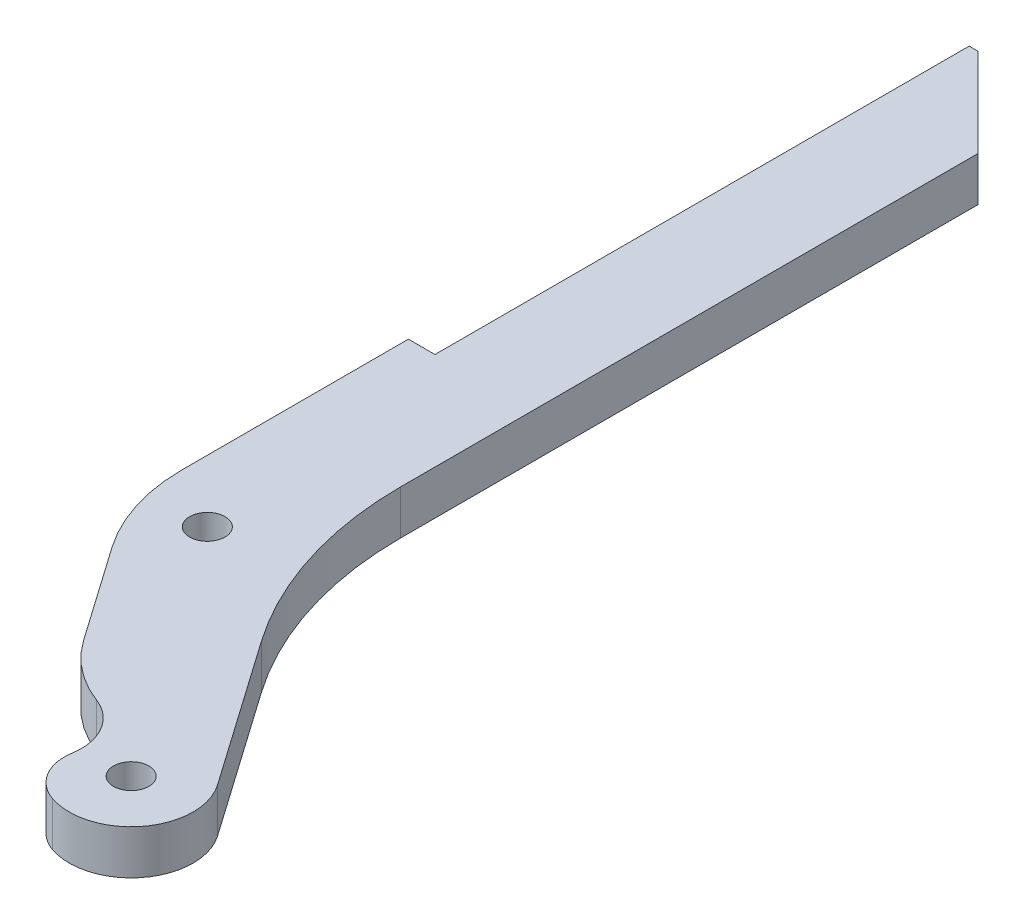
ISO-10303-21;
HEADER;
FILE_DESCRIPTION(('STEP AP214'),'2;1');
FILE_NAME('part.step','',(''),(''),'','','');
FILE_SCHEMA(('AUTOMOTIVE_DESIGN { 1 0 10303 214 1 1 1 1 }'));
ENDSEC;
DATA;
#1=APPLICATION_CONTEXT('core data for automotive mechanical design processes');
#2=APPLICATION_PROTOCOL_DEFINITION('international standard','automotive_design',2000,#1);
#3=PRODUCT_CONTEXT('',#1,'mechanical');
#4=PRODUCT('Part','Part','',(#3));
#5=PRODUCT_RELATED_PRODUCT_CATEGORY('part','',(#4));
#6=PRODUCT_DEFINITION_FORMATION('','',#4);
#7=PRODUCT_DEFINITION_CONTEXT('part definition',#1,'design');
#8=PRODUCT_DEFINITION('design','',#6,#7);
#9=PRODUCT_DEFINITION_SHAPE('','',#8);
#10=(LENGTH_UNIT() NAMED_UNIT(*) SI_UNIT(.MILLI.,.METRE.));
#11=(NAMED_UNIT(*) PLANE_ANGLE_UNIT() SI_UNIT($,.RADIAN.));
#12=(NAMED_UNIT(*) SI_UNIT($,.STERADIAN.) SOLID_ANGLE_UNIT());
#13=UNCERTAINTY_MEASURE_WITH_UNIT(LENGTH_MEASURE(1.E-05),#10,'distance_accuracy_value','');
#14=(GEOMETRIC_REPRESENTATION_CONTEXT(3) GLOBAL_UNCERTAINTY_ASSIGNED_CONTEXT((#13)) GLOBAL_UNIT_ASSIGNED_CONTEXT((#10,
#11,#12)) REPRESENTATION_CONTEXT('',''));
#15=CARTESIAN_POINT('',(0.,0.,0.));
#16=DIRECTION('',(0.,0.,1.));
#17=DIRECTION('',(1.,0.,0.));
#18=AXIS2_PLACEMENT_3D('',#15,#16,#17);
#19=CARTESIAN_POINT('',(-7.,5.,2.20709152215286));
#20=DIRECTION('',(0.819152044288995,0.,-0.573576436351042));
#21=DIRECTION('',(-0.573576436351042,0.,-0.819152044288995));
#22=AXIS2_PLACEMENT_3D('',#19,#20,#21);
#23=PLANE('',#22);
#24=DIRECTION('',(0.573576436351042,0.,0.819152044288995));
#25=VECTOR('',#24,1.);
#26=CARTESIAN_POINT('',(-7.,0.,2.20709152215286));
#27=LINE('',#26,#25);
#28=CARTESIAN_POINT('',(-3.3830408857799,0.,7.37264447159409));
#29=VERTEX_POINT('',#28);
#30=CARTESIAN_POINT('',(4.12992780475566,0.,18.1022757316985));
#31=VERTEX_POINT('',#30);
#32=EDGE_CURVE('E252',#29,#31,#27,.T.);
#33=ORIENTED_EDGE('',*,*,#32,.T.);
#34=DIRECTION('',(0.,1.,0.));
#35=VECTOR('',#34,1.);
#36=CARTESIAN_POINT('',(4.12992780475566,5.,18.1022757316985));
#37=LINE('',#36,#35);
#38=CARTESIAN_POINT('',(4.12992780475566,5.,18.1022757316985));
#39=VERTEX_POINT('',#38);
#40=EDGE_CURVE('E330',#31,#39,#37,.T.);
#41=ORIENTED_EDGE('',*,*,#40,.T.);
#42=DIRECTION('',(0.573576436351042,0.,0.819152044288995));
#43=VECTOR('',#42,1.);
#44=CARTESIAN_POINT('',(-7.,5.,2.20709152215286));
#45=LINE('',#44,#43);
#46=CARTESIAN_POINT('',(-3.3830408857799,5.,7.37264447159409));
#47=VERTEX_POINT('',#46);
#48=EDGE_CURVE('E233',#47,#39,#45,.T.);
#49=ORIENTED_EDGE('',*,*,#48,.F.);
#50=DIRECTION('',(0.,-1.,0.));
#51=VECTOR('',#50,1.);
#52=CARTESIAN_POINT('',(-3.3830408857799,5.,7.37264447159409));
#53=LINE('',#52,#51);
#54=EDGE_CURVE('E279',#47,#29,#53,.T.);
#55=ORIENTED_EDGE('',*,*,#54,.T.);
#56=EDGE_LOOP('',(#33,#41,#49,#55));
#57=FACE_BOUND('',#56,.T.);
#58=ADVANCED_FACE('F50',(#57),#23,.F.);
#59=CARTESIAN_POINT('',(20.0751752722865,0.,28.6703215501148));
#60=DIRECTION('',(0.,1.,0.));
#61=DIRECTION('',(0.,0.,1.));
#62=AXIS2_PLACEMENT_3D('',#59,#60,#61);
#63=PLANE('',#62);
#64=CARTESIAN_POINT('',(0.,0.,0.));
#65=DIRECTION('',(0.,1.,0.));
#66=DIRECTION('',(0.,0.,1.));
#67=AXIS2_PLACEMENT_3D('',#64,#65,#66);
#68=CIRCLE('',#67,2.);
#69=CARTESIAN_POINT('',(0.,0.,2.));
#70=VERTEX_POINT('',#69);
#71=EDGE_CURVE('E210',#70,#70,#68,.T.);
#72=ORIENTED_EDGE('',*,*,#71,.T.);
#73=EDGE_LOOP('',(#72));
#74=FACE_BOUND('',#73,.T.);
#75=CARTESIAN_POINT('',(20.0751752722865,0.,28.6703215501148));
#76=DIRECTION('',(0.,1.,0.));
#77=DIRECTION('',(0.,0.,1.));
#78=AXIS2_PLACEMENT_3D('',#75,#76,#77);
#79=CIRCLE('',#78,2.);
#80=CARTESIAN_POINT('',(20.0751752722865,0.,30.6703215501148));
#81=VERTEX_POINT('',#80);
#82=EDGE_CURVE('E196',#81,#81,#79,.T.);
#83=ORIENTED_EDGE('',*,*,#82,.T.);
#84=EDGE_LOOP('',(#83));
#85=FACE_BOUND('',#84,.T.);
#86=CARTESIAN_POINT('',(20.0751752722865,0.,28.6703215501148));
#87=DIRECTION('',(0.,1.,0.));
#88=DIRECTION('',(0.,0.,1.));
#89=AXIS2_PLACEMENT_3D('',#86,#87,#88);
#90=CIRCLE('',#89,7.);
#91=CARTESIAN_POINT('',(17.7909773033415,0.,35.2871515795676));
#92=VERTEX_POINT('',#91);
#93=CARTESIAN_POINT('',(25.8092395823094,0.,24.6552864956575));
#94=VERTEX_POINT('',#93);
#95=EDGE_CURVE('E253',#92,#94,#90,.T.);
#96=ORIENTED_EDGE('',*,*,#95,.F.);
#97=CARTESIAN_POINT('',(19.4225472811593,0.,30.5608444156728));
#98=DIRECTION('',(0.,1.,0.));
#99=DIRECTION('',(0.,0.,1.));
#100=AXIS2_PLACEMENT_3D('',#97,#98,#99);
#101=CIRCLE('',#100,5.);
#102=CARTESIAN_POINT('',(14.4795454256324,0.,29.8080279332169));
#103=VERTEX_POINT('',#102);
#104=EDGE_CURVE('E68',#92,#103,#101,.F.);
#105=ORIENTED_EDGE('',*,*,#104,.T.);
#106=CARTESIAN_POINT('',(28.3199506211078,0.,31.9159140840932));
#107=DIRECTION('',(0.,1.,0.));
#108=DIRECTION('',(0.,0.,1.));
#109=AXIS2_PLACEMENT_3D('',#106,#107,#108);
#110=CIRCLE('',#109,14.);
#111=CARTESIAN_POINT('',(14.4914739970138,0.,29.7311408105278));
#112=VERTEX_POINT('',#111);
#113=EDGE_CURVE('E325',#103,#112,#110,.F.);
#114=ORIENTED_EDGE('',*,*,#113,.T.);
#115=CARTESIAN_POINT('',(8.56498401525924,0.,28.7948094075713));
#116=DIRECTION('',(0.,1.,0.));
#117=DIRECTION('',(0.,0.,1.));
#118=AXIS2_PLACEMENT_3D('',#115,#116,#117);
#119=CIRCLE('',#118,6.);
#120=CARTESIAN_POINT('',(10.6749057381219,0.,23.178028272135));
#121=VERTEX_POINT('',#120);
#122=EDGE_CURVE('E433',#121,#112,#119,.F.);
#123=ORIENTED_EDGE('',*,*,#122,.F.);
#124=CARTESIAN_POINT('',(15.5980564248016,0.,10.0722056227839));
#125=DIRECTION('',(0.,1.,0.));
#126=DIRECTION('',(0.,0.,1.));
#127=AXIS2_PLACEMENT_3D('',#124,#125,#126);
#128=CIRCLE('',#127,14.);
#129=EDGE_CURVE('E323',#121,#31,#128,.F.);
#130=ORIENTED_EDGE('',*,*,#129,.T.);
#131=ORIENTED_EDGE('',*,*,#32,.F.);
#132=CARTESIAN_POINT('',(13.,0.,-4.09888425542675));
#133=DIRECTION('',(0.,1.,0.));
#134=DIRECTION('',(0.,0.,1.));
#135=AXIS2_PLACEMENT_3D('',#132,#133,#134);
#136=CIRCLE('',#135,20.);
#137=CARTESIAN_POINT('',(-7.,0.,-4.09888425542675));
#138=VERTEX_POINT('',#137);
#139=EDGE_CURVE('E282',#29,#138,#136,.F.);
#140=ORIENTED_EDGE('',*,*,#139,.T.);
#141=DIRECTION('',(0.,0.,1.));
#142=VECTOR('',#141,1.);
#143=CARTESIAN_POINT('',(-7.,0.,2.20709152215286));
#144=LINE('',#143,#142);
#145=CARTESIAN_POINT('',(-7.,0.,-29.7));
#146=VERTEX_POINT('',#145);
#147=EDGE_CURVE('E178',#146,#138,#144,.T.);
#148=ORIENTED_EDGE('',*,*,#147,.F.);
#149=DIRECTION('',(-1.,0.,0.));
#150=VECTOR('',#149,1.);
#151=CARTESIAN_POINT('',(-4.,0.,-29.7));
#152=LINE('',#151,#150);
#153=CARTESIAN_POINT('',(-4.,0.,-29.7));
#154=VERTEX_POINT('',#153);
#155=EDGE_CURVE('E166',#154,#146,#152,.T.);
#156=ORIENTED_EDGE('',*,*,#155,.F.);
#157=DIRECTION('',(0.,0.,1.));
#158=VECTOR('',#157,1.);
#159=CARTESIAN_POINT('',(-4.,0.,-29.7));
#160=LINE('',#159,#158);
#161=CARTESIAN_POINT('',(-4.,0.,-90.));
#162=VERTEX_POINT('',#161);
#163=EDGE_CURVE('E154',#162,#154,#160,.T.);
#164=ORIENTED_EDGE('',*,*,#163,.F.);
#165=DIRECTION('',(-1.,0.,0.));
#166=VECTOR('',#165,1.);
#167=CARTESIAN_POINT('',(-7.,0.,-90.));
#168=LINE('',#167,#166);
#169=CARTESIAN_POINT('',(-3.00000000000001,0.,-90.));
#170=VERTEX_POINT('',#169);
#171=EDGE_CURVE('E246',#170,#162,#168,.T.);
#172=ORIENTED_EDGE('',*,*,#171,.F.);
#173=DIRECTION('',(-0.707106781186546,0.,-0.707106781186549));
#174=VECTOR('',#173,1.);
#175=CARTESIAN_POINT('',(-3.00000000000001,0.,-90.));
#176=LINE('',#175,#174);
#177=CARTESIAN_POINT('',(7.,0.,-79.9999999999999));
#178=VERTEX_POINT('',#177);
#179=EDGE_CURVE('E294',#170,#178,#176,.F.);
#180=ORIENTED_EDGE('',*,*,#179,.T.);
#181=DIRECTION('',(0.,0.,-1.));
#182=VECTOR('',#181,1.);
#183=CARTESIAN_POINT('',(7.,0.,-2.20709152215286));
#184=LINE('',#183,#182);
#185=CARTESIAN_POINT('',(7.,0.,-14.8190430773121));
#186=VERTEX_POINT('',#185);
#187=EDGE_CURVE('E211',#186,#178,#184,.T.);
#188=ORIENTED_EDGE('',*,*,#187,.F.);
#189=CARTESIAN_POINT('',(47.,0.,-14.8190430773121));
#190=DIRECTION('',(0.,1.,0.));
#191=DIRECTION('',(0.,0.,1.));
#192=AXIS2_PLACEMENT_3D('',#189,#190,#191);
#193=CIRCLE('',#192,40.);
#194=CARTESIAN_POINT('',(14.2339182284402,0.,8.12401437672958));
#195=VERTEX_POINT('',#194);
#196=EDGE_CURVE('E272',#186,#195,#193,.T.);
#197=ORIENTED_EDGE('',*,*,#196,.T.);
#198=DIRECTION('',(-0.573576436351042,0.,-0.819152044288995));
#199=VECTOR('',#198,1.);
#200=CARTESIAN_POINT('',(7.,0.,-2.20709152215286));
#201=LINE('',#200,#199);
#202=EDGE_CURVE('E223',#94,#195,#201,.T.);
#203=ORIENTED_EDGE('',*,*,#202,.F.);
#204=EDGE_LOOP('',(#96,#105,#114,#123,#130,#131,#140,#148,#156,#164,#172,#180,#188,#197,#203));
#205=FACE_BOUND('',#204,.T.);
#206=ADVANCED_FACE('F176',(#74,#85,#205),#63,.F.);
#207=CARTESIAN_POINT('',(20.0751752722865,5.,28.6703215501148));
#208=DIRECTION('',(0.,1.,0.));
#209=DIRECTION('',(0.,0.,1.));
#210=AXIS2_PLACEMENT_3D('',#207,#208,#209);
#211=PLANE('',#210);
#212=CARTESIAN_POINT('',(28.3199506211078,5.,31.9159140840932));
#213=DIRECTION('',(0.,1.,0.));
#214=DIRECTION('',(0.,0.,1.));
#215=AXIS2_PLACEMENT_3D('',#212,#213,#214);
#216=CIRCLE('',#215,14.);
#217=CARTESIAN_POINT('',(14.4914739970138,5.,29.7311408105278));
#218=VERTEX_POINT('',#217);
#219=CARTESIAN_POINT('',(14.4795454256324,5.,29.8080279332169));
#220=VERTEX_POINT('',#219);
#221=EDGE_CURVE('E319',#218,#220,#216,.T.);
#222=ORIENTED_EDGE('',*,*,#221,.T.);
#223=CARTESIAN_POINT('',(19.4225472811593,5.,30.5608444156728));
#224=DIRECTION('',(0.,1.,0.));
#225=DIRECTION('',(0.,0.,1.));
#226=AXIS2_PLACEMENT_3D('',#223,#224,#225);
#227=CIRCLE('',#226,5.);
#228=CARTESIAN_POINT('',(17.7909773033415,5.,35.2871515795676));
#229=VERTEX_POINT('',#228);
#230=EDGE_CURVE('E11',#220,#229,#227,.T.);
#231=ORIENTED_EDGE('',*,*,#230,.T.);
#232=CARTESIAN_POINT('',(20.0751752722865,5.,28.6703215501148));
#233=DIRECTION('',(0.,1.,0.));
#234=DIRECTION('',(0.,0.,1.));
#235=AXIS2_PLACEMENT_3D('',#232,#233,#234);
#236=CIRCLE('',#235,7.);
#237=CARTESIAN_POINT('',(25.8092395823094,5.,24.6552864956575));
#238=VERTEX_POINT('',#237);
#239=EDGE_CURVE('E232',#229,#238,#236,.T.);
#240=ORIENTED_EDGE('',*,*,#239,.T.);
#241=DIRECTION('',(-0.573576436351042,0.,-0.819152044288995));
#242=VECTOR('',#241,1.);
#243=CARTESIAN_POINT('',(7.,5.,-2.20709152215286));
#244=LINE('',#243,#242);
#245=CARTESIAN_POINT('',(14.2339182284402,5.,8.12401437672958));
#246=VERTEX_POINT('',#245);
#247=EDGE_CURVE('E238',#238,#246,#244,.T.);
#248=ORIENTED_EDGE('',*,*,#247,.T.);
#249=CARTESIAN_POINT('',(47.,5.,-14.8190430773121));
#250=DIRECTION('',(0.,1.,0.));
#251=DIRECTION('',(0.,0.,1.));
#252=AXIS2_PLACEMENT_3D('',#249,#250,#251);
#253=CIRCLE('',#252,40.);
#254=CARTESIAN_POINT('',(7.,5.,-14.8190430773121));
#255=VERTEX_POINT('',#254);
#256=EDGE_CURVE('E274',#246,#255,#253,.F.);
#257=ORIENTED_EDGE('',*,*,#256,.T.);
#258=DIRECTION('',(0.,0.,-1.));
#259=VECTOR('',#258,1.);
#260=CARTESIAN_POINT('',(7.,5.,-2.20709152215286));
#261=LINE('',#260,#259);
#262=CARTESIAN_POINT('',(7.,5.,-79.9999999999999));
#263=VERTEX_POINT('',#262);
#264=EDGE_CURVE('E216',#255,#263,#261,.T.);
#265=ORIENTED_EDGE('',*,*,#264,.T.);
#266=DIRECTION('',(0.707106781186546,0.,0.707106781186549));
#267=VECTOR('',#266,1.);
#268=CARTESIAN_POINT('',(67.8727484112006,5.,-19.1272515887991));
#269=LINE('',#268,#267);
#270=CARTESIAN_POINT('',(-3.00000000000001,5.,-90.));
#271=VERTEX_POINT('',#270);
#272=EDGE_CURVE('E301',#263,#271,#269,.F.);
#273=ORIENTED_EDGE('',*,*,#272,.T.);
#274=DIRECTION('',(-1.,0.,0.));
#275=VECTOR('',#274,1.);
#276=CARTESIAN_POINT('',(-7.,5.,-90.));
#277=LINE('',#276,#275);
#278=CARTESIAN_POINT('',(-4.,5.,-90.));
#279=VERTEX_POINT('',#278);
#280=EDGE_CURVE('E225',#271,#279,#277,.T.);
#281=ORIENTED_EDGE('',*,*,#280,.T.);
#282=DIRECTION('',(0.,0.,-1.));
#283=VECTOR('',#282,1.);
#284=CARTESIAN_POINT('',(-4.,5.,-29.7));
#285=LINE('',#284,#283);
#286=CARTESIAN_POINT('',(-4.,5.,-29.7));
#287=VERTEX_POINT('',#286);
#288=EDGE_CURVE('E173',#287,#279,#285,.T.);
#289=ORIENTED_EDGE('',*,*,#288,.F.);
#290=DIRECTION('',(-1.,0.,0.));
#291=VECTOR('',#290,1.);
#292=CARTESIAN_POINT('',(-4.,5.,-29.7));
#293=LINE('',#292,#291);
#294=CARTESIAN_POINT('',(-7.,5.,-29.7));
#295=VERTEX_POINT('',#294);
#296=EDGE_CURVE('E171',#287,#295,#293,.T.);
#297=ORIENTED_EDGE('',*,*,#296,.T.);
#298=DIRECTION('',(0.,0.,1.));
#299=VECTOR('',#298,1.);
#300=CARTESIAN_POINT('',(-7.,5.,2.20709152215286));
#301=LINE('',#300,#299);
#302=CARTESIAN_POINT('',(-7.,5.,-4.09888425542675));
#303=VERTEX_POINT('',#302);
#304=EDGE_CURVE('E226',#295,#303,#301,.T.);
#305=ORIENTED_EDGE('',*,*,#304,.T.);
#306=CARTESIAN_POINT('',(13.,5.,-4.09888425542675));
#307=DIRECTION('',(0.,1.,0.));
#308=DIRECTION('',(0.,0.,1.));
#309=AXIS2_PLACEMENT_3D('',#306,#307,#308);
#310=CIRCLE('',#309,20.);
#311=EDGE_CURVE('E290',#303,#47,#310,.T.);
#312=ORIENTED_EDGE('',*,*,#311,.T.);
#313=ORIENTED_EDGE('',*,*,#48,.T.);
#314=CARTESIAN_POINT('',(15.5980564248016,5.,10.0722056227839));
#315=DIRECTION('',(0.,1.,0.));
#316=DIRECTION('',(0.,0.,1.));
#317=AXIS2_PLACEMENT_3D('',#314,#315,#316);
#318=CIRCLE('',#317,14.);
#319=CARTESIAN_POINT('',(10.6749057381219,5.,23.178028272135));
#320=VERTEX_POINT('',#319);
#321=EDGE_CURVE('E314',#39,#320,#318,.T.);
#322=ORIENTED_EDGE('',*,*,#321,.T.);
#323=CARTESIAN_POINT('',(8.56498401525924,5.,28.7948094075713));
#324=DIRECTION('',(0.,1.,0.));
#325=DIRECTION('',(0.,0.,1.));
#326=AXIS2_PLACEMENT_3D('',#323,#324,#325);
#327=CIRCLE('',#326,6.);
#328=EDGE_CURVE('E437',#218,#320,#327,.T.);
#329=ORIENTED_EDGE('',*,*,#328,.F.);
#330=EDGE_LOOP('',(#222,#231,#240,#248,#257,#265,#273,#281,#289,#297,#305,#312,#313,#322,#329));
#331=FACE_BOUND('',#330,.T.);
#332=CARTESIAN_POINT('',(0.,5.,0.));
#333=DIRECTION('',(0.,1.,0.));
#334=DIRECTION('',(0.,0.,1.));
#335=AXIS2_PLACEMENT_3D('',#332,#333,#334);
#336=CIRCLE('',#335,2.);
#337=CARTESIAN_POINT('',(0.,5.,2.));
#338=VERTEX_POINT('',#337);
#339=EDGE_CURVE('E213',#338,#338,#336,.T.);
#340=ORIENTED_EDGE('',*,*,#339,.F.);
#341=EDGE_LOOP('',(#340));
#342=FACE_BOUND('',#341,.T.);
#343=CARTESIAN_POINT('',(20.0751752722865,5.,28.6703215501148));
#344=DIRECTION('',(0.,1.,0.));
#345=DIRECTION('',(0.,0.,1.));
#346=AXIS2_PLACEMENT_3D('',#343,#344,#345);
#347=CIRCLE('',#346,2.);
#348=CARTESIAN_POINT('',(20.0751752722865,5.,30.6703215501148));
#349=VERTEX_POINT('',#348);
#350=EDGE_CURVE('E205',#349,#349,#347,.T.);
#351=ORIENTED_EDGE('',*,*,#350,.F.);
#352=EDGE_LOOP('',(#351));
#353=FACE_BOUND('',#352,.T.);
#354=ADVANCED_FACE('F352',(#331,#342,#353),#211,.T.);
#355=CARTESIAN_POINT('',(-7.,5.,2.20709152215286));
#356=DIRECTION('',(1.,0.,0.));
#357=DIRECTION('',(0.,0.,-1.));
#358=AXIS2_PLACEMENT_3D('',#355,#356,#357);
#359=PLANE('',#358);
#360=DIRECTION('',(0.,1.,0.));
#361=VECTOR('',#360,1.);
#362=CARTESIAN_POINT('',(-7.,0.,-29.7));
#363=LINE('',#362,#361);
#364=EDGE_CURVE('E165',#146,#295,#363,.T.);
#365=ORIENTED_EDGE('',*,*,#364,.F.);
#366=ORIENTED_EDGE('',*,*,#147,.T.);
#367=DIRECTION('',(0.,-1.,0.));
#368=VECTOR('',#367,1.);
#369=CARTESIAN_POINT('',(-7.,5.,-4.09888425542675));
#370=LINE('',#369,#368);
#371=EDGE_CURVE('E281',#138,#303,#370,.F.);
#372=ORIENTED_EDGE('',*,*,#371,.T.);
#373=ORIENTED_EDGE('',*,*,#304,.F.);
#374=EDGE_LOOP('',(#365,#366,#372,#373));
#375=FACE_BOUND('',#374,.T.);
#376=ADVANCED_FACE('F368',(#375),#359,.F.);
#377=CARTESIAN_POINT('',(-7.,5.,-90.));
#378=DIRECTION('',(0.,0.,1.));
#379=DIRECTION('',(1.,0.,0.));
#380=AXIS2_PLACEMENT_3D('',#377,#378,#379);
#381=PLANE('',#380);
#382=DIRECTION('',(0.,-1.,0.));
#383=VECTOR('',#382,1.);
#384=CARTESIAN_POINT('',(-4.,5.,-90.));
#385=LINE('',#384,#383);
#386=EDGE_CURVE('E158',#279,#162,#385,.T.);
#387=ORIENTED_EDGE('',*,*,#386,.F.);
#388=ORIENTED_EDGE('',*,*,#280,.F.);
#389=DIRECTION('',(0.,-1.,0.));
#390=VECTOR('',#389,1.);
#391=CARTESIAN_POINT('',(-3.00000000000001,5.,-90.));
#392=LINE('',#391,#390);
#393=EDGE_CURVE('E293',#271,#170,#392,.T.);
#394=ORIENTED_EDGE('',*,*,#393,.T.);
#395=ORIENTED_EDGE('',*,*,#171,.T.);
#396=EDGE_LOOP('',(#387,#388,#394,#395));
#397=FACE_BOUND('',#396,.T.);
#398=ADVANCED_FACE('F366',(#397),#381,.F.);
#399=CARTESIAN_POINT('',(7.,5.,-2.20709152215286));
#400=DIRECTION('',(-1.,0.,0.));
#401=DIRECTION('',(0.,0.,1.));
#402=AXIS2_PLACEMENT_3D('',#399,#400,#401);
#403=PLANE('',#402);
#404=ORIENTED_EDGE('',*,*,#187,.T.);
#405=DIRECTION('',(0.,1.,0.));
#406=VECTOR('',#405,1.);
#407=CARTESIAN_POINT('',(7.,5.,-79.9999999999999));
#408=LINE('',#407,#406);
#409=EDGE_CURVE('E296',#178,#263,#408,.T.);
#410=ORIENTED_EDGE('',*,*,#409,.T.);
#411=ORIENTED_EDGE('',*,*,#264,.F.);
#412=DIRECTION('',(0.,-1.,0.));
#413=VECTOR('',#412,1.);
#414=CARTESIAN_POINT('',(7.,0.,-14.8190430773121));
#415=LINE('',#414,#413);
#416=EDGE_CURVE('E261',#255,#186,#415,.T.);
#417=ORIENTED_EDGE('',*,*,#416,.T.);
#418=EDGE_LOOP('',(#404,#410,#411,#417));
#419=FACE_BOUND('',#418,.T.);
#420=ADVANCED_FACE('F360',(#419),#403,.F.);
#421=CARTESIAN_POINT('',(20.0751752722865,5.,28.6703215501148));
#422=DIRECTION('',(0.,-1.,0.));
#423=DIRECTION('',(0.,0.,-1.));
#424=AXIS2_PLACEMENT_3D('',#421,#422,#423);
#425=CYLINDRICAL_SURFACE('',#424,7.);
#426=ORIENTED_EDGE('',*,*,#239,.F.);
#427=DIRECTION('',(0.,-1.,0.));
#428=VECTOR('',#427,1.);
#429=CARTESIAN_POINT('',(17.7909773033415,5.,35.2871515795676));
#430=LINE('',#429,#428);
#431=EDGE_CURVE('E328',#229,#92,#430,.T.);
#432=ORIENTED_EDGE('',*,*,#431,.T.);
#433=ORIENTED_EDGE('',*,*,#95,.T.);
#434=DIRECTION('',(0.,-1.,0.));
#435=VECTOR('',#434,1.);
#436=CARTESIAN_POINT('',(25.8092395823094,5.,24.6552864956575));
#437=LINE('',#436,#435);
#438=EDGE_CURVE('E245',#238,#94,#437,.T.);
#439=ORIENTED_EDGE('',*,*,#438,.F.);
#440=EDGE_LOOP('',(#426,#432,#433,#439));
#441=FACE_BOUND('',#440,.T.);
#442=ADVANCED_FACE('F339',(#441),#425,.T.);
#443=CARTESIAN_POINT('',(7.,5.,-2.20709152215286));
#444=DIRECTION('',(-0.819152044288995,0.,0.573576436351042));
#445=DIRECTION('',(0.573576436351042,0.,0.819152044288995));
#446=AXIS2_PLACEMENT_3D('',#443,#444,#445);
#447=PLANE('',#446);
#448=ORIENTED_EDGE('',*,*,#202,.T.);
#449=DIRECTION('',(0.,-1.,0.));
#450=VECTOR('',#449,1.);
#451=CARTESIAN_POINT('',(14.2339182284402,5.,8.12401437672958));
#452=LINE('',#451,#450);
#453=EDGE_CURVE('E270',#195,#246,#452,.F.);
#454=ORIENTED_EDGE('',*,*,#453,.T.);
#455=ORIENTED_EDGE('',*,*,#247,.F.);
#456=ORIENTED_EDGE('',*,*,#438,.T.);
#457=EDGE_LOOP('',(#448,#454,#455,#456));
#458=FACE_BOUND('',#457,.T.);
#459=ADVANCED_FACE('F350',(#458),#447,.F.);
#460=CARTESIAN_POINT('',(0.,5.,0.));
#461=DIRECTION('',(0.,-1.,0.));
#462=DIRECTION('',(0.,0.,-1.));
#463=AXIS2_PLACEMENT_3D('',#460,#461,#462);
#464=CYLINDRICAL_SURFACE('',#463,2.);
#465=ORIENTED_EDGE('',*,*,#339,.T.);
#466=EDGE_LOOP('',(#465));
#467=FACE_BOUND('',#466,.T.);
#468=ORIENTED_EDGE('',*,*,#71,.F.);
#469=EDGE_LOOP('',(#468));
#470=FACE_BOUND('',#469,.T.);
#471=ADVANCED_FACE('F395',(#467,#470),#464,.F.);
#472=CARTESIAN_POINT('',(20.0751752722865,5.,28.6703215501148));
#473=DIRECTION('',(0.,-1.,0.));
#474=DIRECTION('',(0.,0.,-1.));
#475=AXIS2_PLACEMENT_3D('',#472,#473,#474);
#476=CYLINDRICAL_SURFACE('',#475,2.);
#477=ORIENTED_EDGE('',*,*,#350,.T.);
#478=EDGE_LOOP('',(#477));
#479=FACE_BOUND('',#478,.T.);
#480=ORIENTED_EDGE('',*,*,#82,.F.);
#481=EDGE_LOOP('',(#480));
#482=FACE_BOUND('',#481,.T.);
#483=ADVANCED_FACE('F400',(#479,#482),#476,.F.);
#484=CARTESIAN_POINT('',(47.,5.,-14.8190430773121));
#485=DIRECTION('',(0.,1.,0.));
#486=DIRECTION('',(0.,0.,1.));
#487=AXIS2_PLACEMENT_3D('',#484,#485,#486);
#488=CYLINDRICAL_SURFACE('',#487,40.);
#489=ORIENTED_EDGE('',*,*,#256,.F.);
#490=ORIENTED_EDGE('',*,*,#453,.F.);
#491=ORIENTED_EDGE('',*,*,#196,.F.);
#492=ORIENTED_EDGE('',*,*,#416,.F.);
#493=EDGE_LOOP('',(#489,#490,#491,#492));
#494=FACE_BOUND('',#493,.T.);
#495=ADVANCED_FACE('F354',(#494),#488,.F.);
#496=CARTESIAN_POINT('',(13.,5.,-4.09888425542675));
#497=DIRECTION('',(0.,-1.,0.));
#498=DIRECTION('',(0.,0.,-1.));
#499=AXIS2_PLACEMENT_3D('',#496,#497,#498);
#500=CYLINDRICAL_SURFACE('',#499,20.);
#501=ORIENTED_EDGE('',*,*,#311,.F.);
#502=ORIENTED_EDGE('',*,*,#371,.F.);
#503=ORIENTED_EDGE('',*,*,#139,.F.);
#504=ORIENTED_EDGE('',*,*,#54,.F.);
#505=EDGE_LOOP('',(#501,#502,#503,#504));
#506=FACE_BOUND('',#505,.T.);
#507=ADVANCED_FACE('F455',(#506),#500,.T.);
#508=CARTESIAN_POINT('',(-3.00000000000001,5.,-90.));
#509=DIRECTION('',(-0.707106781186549,0.,0.707106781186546));
#510=DIRECTION('',(0.,-1.,0.));
#511=AXIS2_PLACEMENT_3D('',#508,#509,#510);
#512=PLANE('',#511);
#513=ORIENTED_EDGE('',*,*,#272,.F.);
#514=ORIENTED_EDGE('',*,*,#409,.F.);
#515=ORIENTED_EDGE('',*,*,#179,.F.);
#516=ORIENTED_EDGE('',*,*,#393,.F.);
#517=EDGE_LOOP('',(#513,#514,#515,#516));
#518=FACE_BOUND('',#517,.T.);
#519=ADVANCED_FACE('F365',(#518),#512,.F.);
#520=CARTESIAN_POINT('',(-4.,0.,0.));
#521=DIRECTION('',(-1.,0.,0.));
#522=DIRECTION('',(0.,0.,1.));
#523=AXIS2_PLACEMENT_3D('',#520,#521,#522);
#524=PLANE('',#523);
#525=CARTESIAN_POINT('',(-4.,2.5,-45.));
#526=DIRECTION('',(-1.,0.,0.));
#527=DIRECTION('',(0.,0.,1.));
#528=AXIS2_PLACEMENT_3D('',#525,#526,#527);
#529=CIRCLE('',#528,1.5);
#530=CARTESIAN_POINT('',(-4.,2.5,-43.5));
#531=VERTEX_POINT('',#530);
#532=EDGE_CURVE('E189',#531,#531,#529,.F.);
#533=ORIENTED_EDGE('',*,*,#532,.T.);
#534=EDGE_LOOP('',(#533));
#535=FACE_BOUND('',#534,.T.);
#536=CARTESIAN_POINT('',(-4.,2.5,-75.));
#537=DIRECTION('',(-1.,0.,0.));
#538=DIRECTION('',(0.,0.,1.));
#539=AXIS2_PLACEMENT_3D('',#536,#537,#538);
#540=CIRCLE('',#539,1.5);
#541=CARTESIAN_POINT('',(-4.,2.5,-73.5));
#542=VERTEX_POINT('',#541);
#543=EDGE_CURVE('E182',#542,#542,#540,.F.);
#544=ORIENTED_EDGE('',*,*,#543,.T.);
#545=EDGE_LOOP('',(#544));
#546=FACE_BOUND('',#545,.T.);
#547=ORIENTED_EDGE('',*,*,#386,.T.);
#548=ORIENTED_EDGE('',*,*,#163,.T.);
#549=DIRECTION('',(0.,1.,0.));
#550=VECTOR('',#549,1.);
#551=CARTESIAN_POINT('',(-4.,0.,-29.7));
#552=LINE('',#551,#550);
#553=EDGE_CURVE('E159',#154,#287,#552,.T.);
#554=ORIENTED_EDGE('',*,*,#553,.T.);
#555=ORIENTED_EDGE('',*,*,#288,.T.);
#556=EDGE_LOOP('',(#547,#548,#554,#555));
#557=FACE_BOUND('',#556,.T.);
#558=ADVANCED_FACE('F153',(#535,#546,#557),#524,.T.);
#559=CARTESIAN_POINT('',(-4.,0.,-29.7));
#560=DIRECTION('',(0.,0.,1.));
#561=DIRECTION('',(1.,0.,0.));
#562=AXIS2_PLACEMENT_3D('',#559,#560,#561);
#563=PLANE('',#562);
#564=ORIENTED_EDGE('',*,*,#364,.T.);
#565=ORIENTED_EDGE('',*,*,#296,.F.);
#566=ORIENTED_EDGE('',*,*,#553,.F.);
#567=ORIENTED_EDGE('',*,*,#155,.T.);
#568=EDGE_LOOP('',(#564,#565,#566,#567));
#569=FACE_BOUND('',#568,.T.);
#570=ADVANCED_FACE('F170',(#569),#563,.F.);
#571=CARTESIAN_POINT('',(3.,2.5,-45.));
#572=DIRECTION('',(1.,0.,0.));
#573=DIRECTION('',(0.,0.,-1.));
#574=AXIS2_PLACEMENT_3D('',#571,#572,#573);
#575=PLANE('',#574);
#576=CARTESIAN_POINT('',(3.,2.5,-45.));
#577=DIRECTION('',(-1.,0.,0.));
#578=DIRECTION('',(0.,0.,-1.));
#579=AXIS2_PLACEMENT_3D('',#576,#577,#578);
#580=CIRCLE('',#579,1.5);
#581=CARTESIAN_POINT('',(3.,2.5,-46.5));
#582=VERTEX_POINT('',#581);
#583=EDGE_CURVE('E195',#582,#582,#580,.T.);
#584=ORIENTED_EDGE('',*,*,#583,.T.);
#585=EDGE_LOOP('',(#584));
#586=FACE_BOUND('',#585,.T.);
#587=ADVANCED_FACE('F409',(#586),#575,.F.);
#588=CARTESIAN_POINT('',(3.,2.5,-45.));
#589=DIRECTION('',(-1.,0.,0.));
#590=DIRECTION('',(0.,0.,1.));
#591=AXIS2_PLACEMENT_3D('',#588,#589,#590);
#592=CYLINDRICAL_SURFACE('',#591,1.5);
#593=ORIENTED_EDGE('',*,*,#583,.F.);
#594=EDGE_LOOP('',(#593));
#595=FACE_BOUND('',#594,.T.);
#596=ORIENTED_EDGE('',*,*,#532,.F.);
#597=EDGE_LOOP('',(#596));
#598=FACE_BOUND('',#597,.T.);
#599=ADVANCED_FACE('F401',(#595,#598),#592,.F.);
#600=CARTESIAN_POINT('',(3.,2.5,-75.));
#601=DIRECTION('',(-1.,0.,0.));
#602=DIRECTION('',(0.,0.,1.));
#603=AXIS2_PLACEMENT_3D('',#600,#601,#602);
#604=PLANE('',#603);
#605=CARTESIAN_POINT('',(3.,2.5,-75.));
#606=DIRECTION('',(-1.,0.,0.));
#607=DIRECTION('',(0.,0.,1.));
#608=AXIS2_PLACEMENT_3D('',#605,#606,#607);
#609=CIRCLE('',#608,1.5);
#610=CARTESIAN_POINT('',(3.,2.5,-73.5));
#611=VERTEX_POINT('',#610);
#612=EDGE_CURVE('E191',#611,#611,#609,.T.);
#613=ORIENTED_EDGE('',*,*,#612,.T.);
#614=EDGE_LOOP('',(#613));
#615=FACE_BOUND('',#614,.T.);
#616=ADVANCED_FACE('F408',(#615),#604,.T.);
#617=CARTESIAN_POINT('',(3.,2.5,-75.));
#618=DIRECTION('',(-1.,0.,0.));
#619=DIRECTION('',(0.,0.,1.));
#620=AXIS2_PLACEMENT_3D('',#617,#618,#619);
#621=CYLINDRICAL_SURFACE('',#620,1.5);
#622=ORIENTED_EDGE('',*,*,#612,.F.);
#623=EDGE_LOOP('',(#622));
#624=FACE_BOUND('',#623,.T.);
#625=ORIENTED_EDGE('',*,*,#543,.F.);
#626=EDGE_LOOP('',(#625));
#627=FACE_BOUND('',#626,.T.);
#628=ADVANCED_FACE('F415',(#624,#627),#621,.F.);
#629=CARTESIAN_POINT('',(8.56498401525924,-0.00100000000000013,28.7948094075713));
#630=DIRECTION('',(0.,1.,0.));
#631=DIRECTION('',(0.,0.,1.));
#632=AXIS2_PLACEMENT_3D('',#629,#630,#631);
#633=CYLINDRICAL_SURFACE('',#632,6.);
#634=ORIENTED_EDGE('',*,*,#122,.T.);
#635=DIRECTION('',(0.,1.,0.));
#636=VECTOR('',#635,1.);
#637=CARTESIAN_POINT('',(14.4914739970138,-0.00100000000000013,29.7311408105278));
#638=LINE('',#637,#636);
#639=EDGE_CURVE('E311',#112,#218,#638,.T.);
#640=ORIENTED_EDGE('',*,*,#639,.T.);
#641=ORIENTED_EDGE('',*,*,#328,.T.);
#642=DIRECTION('',(0.,1.,0.));
#643=VECTOR('',#642,1.);
#644=CARTESIAN_POINT('',(10.6749057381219,-0.00100000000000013,23.178028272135));
#645=LINE('',#644,#643);
#646=EDGE_CURVE('E302',#320,#121,#645,.F.);
#647=ORIENTED_EDGE('',*,*,#646,.T.);
#648=EDGE_LOOP('',(#634,#640,#641,#647));
#649=FACE_BOUND('',#648,.T.);
#650=ADVANCED_FACE('F411',(#649),#633,.F.);
#651=CARTESIAN_POINT('',(28.3199506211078,5.,31.9159140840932));
#652=DIRECTION('',(0.,1.,0.));
#653=DIRECTION('',(0.,0.,1.));
#654=AXIS2_PLACEMENT_3D('',#651,#652,#653);
#655=CYLINDRICAL_SURFACE('',#654,14.);
#656=ORIENTED_EDGE('',*,*,#113,.F.);
#657=DIRECTION('',(0.,1.,0.));
#658=VECTOR('',#657,1.);
#659=CARTESIAN_POINT('',(14.4795454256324,5.,29.8080279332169));
#660=LINE('',#659,#658);
#661=EDGE_CURVE('E57',#103,#220,#660,.T.);
#662=ORIENTED_EDGE('',*,*,#661,.T.);
#663=ORIENTED_EDGE('',*,*,#221,.F.);
#664=ORIENTED_EDGE('',*,*,#639,.F.);
#665=EDGE_LOOP('',(#656,#662,#663,#664));
#666=FACE_BOUND('',#665,.T.);
#667=ADVANCED_FACE('F421',(#666),#655,.T.);
#668=CARTESIAN_POINT('',(15.5980564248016,-0.00100000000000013,10.0722056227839));
#669=DIRECTION('',(0.,1.,0.));
#670=DIRECTION('',(0.,0.,1.));
#671=AXIS2_PLACEMENT_3D('',#668,#669,#670);
#672=CYLINDRICAL_SURFACE('',#671,14.);
#673=ORIENTED_EDGE('',*,*,#321,.F.);
#674=ORIENTED_EDGE('',*,*,#40,.F.);
#675=ORIENTED_EDGE('',*,*,#129,.F.);
#676=ORIENTED_EDGE('',*,*,#646,.F.);
#677=EDGE_LOOP('',(#673,#674,#675,#676));
#678=FACE_BOUND('',#677,.T.);
#679=ADVANCED_FACE('F429',(#678),#672,.T.);
#680=CARTESIAN_POINT('',(19.4225472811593,5.,30.5608444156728));
#681=DIRECTION('',(0.,-1.,0.));
#682=DIRECTION('',(0.,0.,-1.));
#683=AXIS2_PLACEMENT_3D('',#680,#681,#682);
#684=CYLINDRICAL_SURFACE('',#683,5.);
#685=ORIENTED_EDGE('',*,*,#230,.F.);
#686=ORIENTED_EDGE('',*,*,#661,.F.);
#687=ORIENTED_EDGE('',*,*,#104,.F.);
#688=ORIENTED_EDGE('',*,*,#431,.F.);
#689=EDGE_LOOP('',(#685,#686,#687,#688));
#690=FACE_BOUND('',#689,.T.);
#691=ADVANCED_FACE('F47',(#690),#684,.T.);
#692=CLOSED_SHELL('',(#58,#206,#354,#376,#398,#420,#442,#459,#471,#483,#495,#507,#519,#558,#570,
#587,#599,#616,#628,#650,#667,#679,#691));
#693=MANIFOLD_SOLID_BREP('B2',#692);
#694=ADVANCED_BREP_SHAPE_REPRESENTATION('',(#18,#693),#14);
#695=SHAPE_DEFINITION_REPRESENTATION(#9,#694);
ENDSEC;
END-ISO-10303-21;
